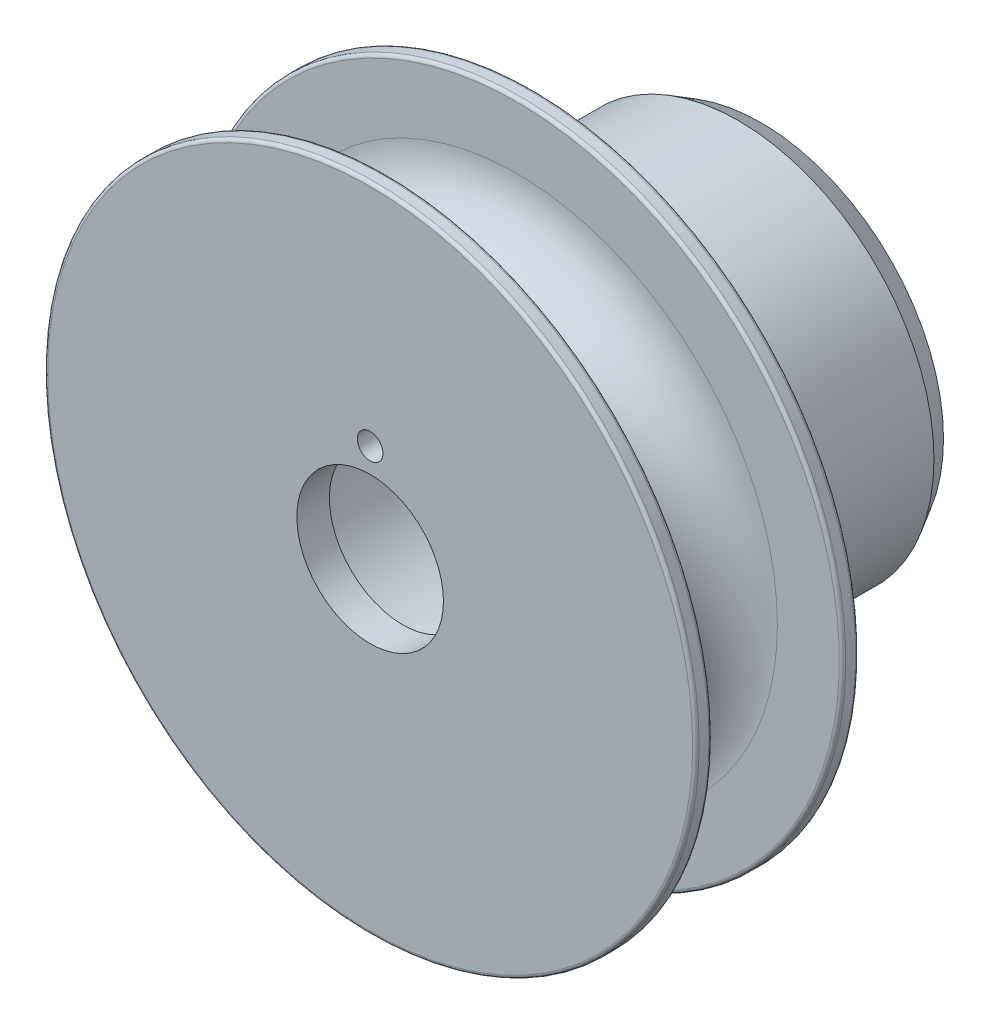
ISO-10303-21;
HEADER;
FILE_DESCRIPTION(('STEP AP214'),'2;1');
FILE_NAME('part.step','',(''),(''),'','','');
FILE_SCHEMA(('AUTOMOTIVE_DESIGN { 1 0 10303 214 1 1 1 1 }'));
ENDSEC;
DATA;
#1=APPLICATION_CONTEXT('core data for automotive mechanical design processes');
#2=APPLICATION_PROTOCOL_DEFINITION('international standard','automotive_design',2000,#1);
#3=PRODUCT_CONTEXT('',#1,'mechanical');
#4=PRODUCT('Part','Part','',(#3));
#5=PRODUCT_RELATED_PRODUCT_CATEGORY('part','',(#4));
#6=PRODUCT_DEFINITION_FORMATION('','',#4);
#7=PRODUCT_DEFINITION_CONTEXT('part definition',#1,'design');
#8=PRODUCT_DEFINITION('design','',#6,#7);
#9=PRODUCT_DEFINITION_SHAPE('','',#8);
#10=(LENGTH_UNIT() NAMED_UNIT(*) SI_UNIT(.MILLI.,.METRE.));
#11=(NAMED_UNIT(*) PLANE_ANGLE_UNIT() SI_UNIT($,.RADIAN.));
#12=(NAMED_UNIT(*) SI_UNIT($,.STERADIAN.) SOLID_ANGLE_UNIT());
#13=UNCERTAINTY_MEASURE_WITH_UNIT(LENGTH_MEASURE(1.E-05),#10,'distance_accuracy_value','');
#14=(GEOMETRIC_REPRESENTATION_CONTEXT(3) GLOBAL_UNCERTAINTY_ASSIGNED_CONTEXT((#13)) GLOBAL_UNIT_ASSIGNED_CONTEXT((#10,
#11,#12)) REPRESENTATION_CONTEXT('',''));
#15=CARTESIAN_POINT('',(0.,0.,0.));
#16=DIRECTION('',(0.,0.,1.));
#17=DIRECTION('',(1.,0.,0.));
#18=AXIS2_PLACEMENT_3D('',#15,#16,#17);
#19=CARTESIAN_POINT('',(0.,0.,-101.6));
#20=DIRECTION('',(0.,0.,1.));
#21=DIRECTION('',(1.,0.,0.));
#22=AXIS2_PLACEMENT_3D('',#19,#20,#21);
#23=CYLINDRICAL_SURFACE('',#22,22.225);
#24=CARTESIAN_POINT('',(0.,0.,-99.06));
#25=DIRECTION('',(0.,0.,1.));
#26=DIRECTION('',(1.,0.,0.));
#27=AXIS2_PLACEMENT_3D('',#24,#25,#26);
#28=CIRCLE('',#27,22.225);
#29=CARTESIAN_POINT('',(22.225,0.,-99.06));
#30=VERTEX_POINT('',#29);
#31=EDGE_CURVE('E50',#30,#30,#28,.F.);
#32=ORIENTED_EDGE('',*,*,#31,.T.);
#33=EDGE_LOOP('',(#32));
#34=FACE_BOUND('',#33,.T.);
#35=CARTESIAN_POINT('',(-22.225,0.,-94.715));
#36=CARTESIAN_POINT('',(-22.2249984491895,-0.25700302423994,-94.714998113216));
#37=CARTESIAN_POINT('',(-22.2205302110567,-0.514080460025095,-94.7046927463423));
#38=CARTESIAN_POINT('',(-22.2027681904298,-1.02639323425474,-94.66357035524));
#39=CARTESIAN_POINT('',(-22.1894691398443,-1.28162738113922,-94.6327410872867));
#40=CARTESIAN_POINT('',(-22.1543583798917,-1.78878973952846,-94.5508122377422));
#41=CARTESIAN_POINT('',(-22.132528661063,-2.04070978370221,-94.4996697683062));
#42=CARTESIAN_POINT('',(-22.080927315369,-2.53889834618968,-94.3776479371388));
#43=CARTESIAN_POINT('',(-22.0511551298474,-2.78516646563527,-94.3067671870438));
#44=CARTESIAN_POINT('',(-21.9845493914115,-3.26951998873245,-94.1462531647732));
#45=CARTESIAN_POINT('',(-21.947741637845,-3.50763165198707,-94.0566883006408));
#46=CARTESIAN_POINT('',(-21.8679013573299,-3.9751438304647,-93.8594491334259));
#47=CARTESIAN_POINT('',(-21.8248686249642,-4.20454405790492,-93.7517742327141));
#48=CARTESIAN_POINT('',(-21.7336249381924,-4.65322871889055,-93.5192281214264));
#49=CARTESIAN_POINT('',(-21.6854167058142,-4.87251838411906,-93.3943659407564));
#50=CARTESIAN_POINT('',(-21.5849243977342,-5.29999757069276,-93.1282904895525));
#51=CARTESIAN_POINT('',(-21.5326388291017,-5.50818297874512,-92.9870712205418));
#52=CARTESIAN_POINT('',(-21.3662338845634,-6.13403580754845,-92.5257927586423));
#53=CARTESIAN_POINT('',(-21.2471273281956,-6.53133021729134,-92.1793014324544));
#54=CARTESIAN_POINT('',(-21.0078722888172,-7.26423095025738,-91.4262336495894));
#55=CARTESIAN_POINT('',(-20.887723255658,-7.59980232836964,-91.0196233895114));
#56=CARTESIAN_POINT('',(-20.7130683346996,-8.05904923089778,-90.3596841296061));
#57=CARTESIAN_POINT('',(-20.6543616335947,-8.20794569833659,-90.1246672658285));
#58=CARTESIAN_POINT('',(-20.5419899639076,-8.48525995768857,-89.6417494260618));
#59=CARTESIAN_POINT('',(-20.4883229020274,-8.61368626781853,-89.3938538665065));
#60=CARTESIAN_POINT('',(-20.3878274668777,-8.84892611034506,-88.886742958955));
#61=CARTESIAN_POINT('',(-20.3409977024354,-8.95574404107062,-88.627529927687));
#62=CARTESIAN_POINT('',(-20.25584793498,-9.14670397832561,-88.0995209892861));
#63=CARTESIAN_POINT('',(-20.2175272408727,-9.23084782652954,-87.8307258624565));
#64=CARTESIAN_POINT('',(-20.152564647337,-9.3717916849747,-87.2994769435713));
#65=CARTESIAN_POINT('',(-20.1254284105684,-9.42976348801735,-87.0373945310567));
#66=CARTESIAN_POINT('',(-20.0811514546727,-9.52369096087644,-86.5084730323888));
#67=CARTESIAN_POINT('',(-20.0640104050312,-9.55964735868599,-86.2416341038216));
#68=CARTESIAN_POINT('',(-20.0403901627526,-9.60906556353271,-85.7055514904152));
#69=CARTESIAN_POINT('',(-20.0339053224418,-9.62253928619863,-85.4363091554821));
#70=CARTESIAN_POINT('',(-20.0318367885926,-9.62684535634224,-84.8976092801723));
#71=CARTESIAN_POINT('',(-20.0362524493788,-9.61767904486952,-84.6281517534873));
#72=CARTESIAN_POINT('',(-20.0549789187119,-9.57856212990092,-84.1140244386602));
#73=CARTESIAN_POINT('',(-20.0684231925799,-9.55043086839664,-83.8691818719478));
#74=CARTESIAN_POINT('',(-20.103864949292,-9.47559776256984,-83.3828948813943));
#75=CARTESIAN_POINT('',(-20.1258653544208,-9.42888957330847,-83.1414516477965));
#76=CARTESIAN_POINT('',(-20.1777230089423,-9.31739712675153,-82.6637072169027));
#77=CARTESIAN_POINT('',(-20.2075784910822,-9.25261693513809,-82.4274048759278));
#78=CARTESIAN_POINT('',(-20.2742681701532,-9.10555810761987,-81.9612300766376));
#79=CARTESIAN_POINT('',(-20.3111051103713,-9.02327259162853,-81.7313601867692));
#80=CARTESIAN_POINT('',(-20.3915685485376,-8.83995391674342,-81.2745429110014));
#81=CARTESIAN_POINT('',(-20.4353242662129,-8.73855492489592,-81.0477652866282));
#82=CARTESIAN_POINT('',(-20.5278342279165,-8.51896941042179,-80.603439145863));
#83=CARTESIAN_POINT('',(-20.5765906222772,-8.40077565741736,-80.3858946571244));
#84=CARTESIAN_POINT('',(-20.6778250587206,-8.1484142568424,-79.9611600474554));
#85=CARTESIAN_POINT('',(-20.7303035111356,-8.01424484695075,-79.7539710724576));
#86=CARTESIAN_POINT('',(-20.8376919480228,-7.73073065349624,-79.3509105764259));
#87=CARTESIAN_POINT('',(-20.8926020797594,-7.58138495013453,-79.1550397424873));
#88=CARTESIAN_POINT('',(-21.0086921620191,-7.25385262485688,-78.7579826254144));
#89=CARTESIAN_POINT('',(-21.0699831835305,-7.07427635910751,-78.5579731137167));
#90=CARTESIAN_POINT('',(-21.1922688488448,-6.69905124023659,-78.17368323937));
#91=CARTESIAN_POINT('',(-21.2532635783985,-6.50340737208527,-77.9893980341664));
#92=CARTESIAN_POINT('',(-21.3734195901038,-6.09692524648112,-77.6374539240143));
#93=CARTESIAN_POINT('',(-21.4325796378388,-5.88607706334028,-77.4698060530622));
#94=CARTESIAN_POINT('',(-21.5474582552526,-5.45053807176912,-77.1524416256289));
#95=CARTESIAN_POINT('',(-21.6031781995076,-5.2258528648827,-77.0027178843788));
#96=CARTESIAN_POINT('',(-21.7111818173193,-4.75757123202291,-76.7184305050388));
#97=CARTESIAN_POINT('',(-21.7633316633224,-4.51362754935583,-76.58438688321));
#98=CARTESIAN_POINT('',(-21.8610070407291,-4.01394963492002,-76.3374867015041));
#99=CARTESIAN_POINT('',(-21.9065323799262,-3.75821506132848,-76.2246307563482));
#100=CARTESIAN_POINT('',(-21.9896080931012,-3.23687977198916,-76.0212913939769));
#101=CARTESIAN_POINT('',(-22.0271623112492,-2.97128388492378,-75.9307971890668));
#102=CARTESIAN_POINT('',(-22.0931877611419,-2.43216034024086,-75.7731293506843));
#103=CARTESIAN_POINT('',(-22.1216597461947,-2.15863334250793,-75.705953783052));
#104=CARTESIAN_POINT('',(-22.1670596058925,-1.6245112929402,-75.599442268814));
#105=CARTESIAN_POINT('',(-22.1846349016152,-1.36428313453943,-75.5585382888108));
#106=CARTESIAN_POINT('',(-22.2106314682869,-0.840898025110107,-75.4981859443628));
#107=CARTESIAN_POINT('',(-22.2190531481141,-0.577741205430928,-75.4787366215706));
#108=CARTESIAN_POINT('',(-22.2265047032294,-0.0506593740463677,-75.4615229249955));
#109=CARTESIAN_POINT('',(-22.2255371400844,0.213265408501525,-75.4637526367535));
#110=CARTESIAN_POINT('',(-22.2142434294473,0.739836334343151,-75.489856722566));
#111=CARTESIAN_POINT('',(-22.2039175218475,1.00248251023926,-75.5137305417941));
#112=CARTESIAN_POINT('',(-22.1750118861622,1.51015077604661,-75.5809510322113));
#113=CARTESIAN_POINT('',(-22.156913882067,1.75535181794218,-75.6231626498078));
#114=CARTESIAN_POINT('',(-22.1130645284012,2.24108553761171,-75.7262508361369));
#115=CARTESIAN_POINT('',(-22.0873135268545,2.48161842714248,-75.7871265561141));
#116=CARTESIAN_POINT('',(-22.0287816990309,2.95645494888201,-75.9269627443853));
#117=CARTESIAN_POINT('',(-21.9960015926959,3.19075921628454,-76.0059213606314));
#118=CARTESIAN_POINT('',(-21.9241670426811,3.65184898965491,-76.1812686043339));
#119=CARTESIAN_POINT('',(-21.8851101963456,3.87863157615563,-76.2776639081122));
#120=CARTESIAN_POINT('',(-21.8003278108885,4.33020839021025,-76.4903430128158));
#121=CARTESIAN_POINT('',(-21.7544337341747,4.55472551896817,-76.6071485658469));
#122=CARTESIAN_POINT('',(-21.6580086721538,4.99317186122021,-76.8575842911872));
#123=CARTESIAN_POINT('',(-21.6074759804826,5.20709713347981,-76.9912206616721));
#124=CARTESIAN_POINT('',(-21.4506535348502,5.83126945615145,-77.4160163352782));
#125=CARTESIAN_POINT('',(-21.3390902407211,6.2241643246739,-77.7311812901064));
#126=CARTESIAN_POINT('',(-21.1032903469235,6.98370218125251,-78.4446677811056));
#127=CARTESIAN_POINT('',(-20.9787387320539,7.34600645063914,-78.8475189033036));
#128=CARTESIAN_POINT('',(-20.7986293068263,7.83569112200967,-79.4939381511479));
#129=CARTESIAN_POINT('',(-20.7396738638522,7.99004593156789,-79.7166044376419));
#130=CARTESIAN_POINT('',(-20.6257006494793,8.27981243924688,-80.1748481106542));
#131=CARTESIAN_POINT('',(-20.5706812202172,8.41523213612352,-80.4104199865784));
#132=CARTESIAN_POINT('',(-20.465216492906,8.66860839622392,-80.8980004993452));
#133=CARTESIAN_POINT('',(-20.4148848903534,8.78616083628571,-81.150243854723));
#134=CARTESIAN_POINT('',(-20.3218141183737,8.99933476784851,-81.665067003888));
#135=CARTESIAN_POINT('',(-20.2790714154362,9.09496647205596,-81.9276419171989));
#136=CARTESIAN_POINT('',(-20.2027446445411,9.2632760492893,-82.4612069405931));
#137=CARTESIAN_POINT('',(-20.1691558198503,9.33596584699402,-82.7321925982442));
#138=CARTESIAN_POINT('',(-20.1124315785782,9.45754943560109,-83.2805201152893));
#139=CARTESIAN_POINT('',(-20.0892950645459,9.50644572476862,-83.5578613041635));
#140=CARTESIAN_POINT('',(-20.0558525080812,9.57678354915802,-84.0936237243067));
#141=CARTESIAN_POINT('',(-20.0446524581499,9.60014217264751,-84.3517389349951));
#142=CARTESIAN_POINT('',(-20.0322699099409,9.62595450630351,-84.8692477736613));
#143=CARTESIAN_POINT('',(-20.0310868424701,9.62840940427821,-85.1286413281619));
#144=CARTESIAN_POINT('',(-20.0387807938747,9.61238599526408,-85.6465833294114));
#145=CARTESIAN_POINT('',(-20.0476561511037,9.59391114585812,-85.9051319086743));
#146=CARTESIAN_POINT('',(-20.0751420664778,9.53626300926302,-86.419381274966));
#147=CARTESIAN_POINT('',(-20.0937525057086,9.49708997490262,-86.6750820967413));
#148=CARTESIAN_POINT('',(-20.1387835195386,9.40120507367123,-87.1678595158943));
#149=CARTESIAN_POINT('',(-20.1647221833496,9.3455676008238,-87.40519071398));
#150=CARTESIAN_POINT('',(-20.2239346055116,9.21673028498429,-87.8741815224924));
#151=CARTESIAN_POINT('',(-20.2572108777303,9.14352442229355,-88.1058391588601));
#152=CARTESIAN_POINT('',(-20.3301335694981,8.98021610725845,-88.562036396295));
#153=CARTESIAN_POINT('',(-20.3697790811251,8.89011606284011,-88.7865770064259));
#154=CARTESIAN_POINT('',(-20.4543875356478,8.69368102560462,-89.2274883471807));
#155=CARTESIAN_POINT('',(-20.4993524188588,8.58734010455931,-89.4438560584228));
#156=CARTESIAN_POINT('',(-20.5963860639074,8.35204705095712,-89.8805350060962));
#157=CARTESIAN_POINT('',(-20.6487230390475,8.22209795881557,-90.1002496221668));
#158=CARTESIAN_POINT('',(-20.7566917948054,7.94558964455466,-90.5281175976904));
#159=CARTESIAN_POINT('',(-20.8123237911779,7.79902933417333,-90.7362701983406));
#160=CARTESIAN_POINT('',(-20.9254899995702,7.49009752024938,-91.1401010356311));
#161=CARTESIAN_POINT('',(-20.9830250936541,7.32771861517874,-91.3357733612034));
#162=CARTESIAN_POINT('',(-21.0985509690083,6.98812771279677,-91.7135329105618));
#163=CARTESIAN_POINT('',(-21.1565416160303,6.81091994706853,-91.8956239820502));
#164=CARTESIAN_POINT('',(-21.2763321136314,6.42743243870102,-92.2596740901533));
#165=CARTESIAN_POINT('',(-21.3380557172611,6.21996035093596,-92.440404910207));
#166=CARTESIAN_POINT('',(-21.4587450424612,5.78988330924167,-92.7837353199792));
#167=CARTESIAN_POINT('',(-21.5177116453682,5.56728324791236,-92.9463407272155));
#168=CARTESIAN_POINT('',(-21.6313411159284,5.10800344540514,-93.2524218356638));
#169=CARTESIAN_POINT('',(-21.6860008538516,4.87131368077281,-93.3958836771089));
#170=CARTESIAN_POINT('',(-21.7894465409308,4.38546620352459,-93.6623427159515));
#171=CARTESIAN_POINT('',(-21.8382329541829,4.13630947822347,-93.7853415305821));
#172=CARTESIAN_POINT('',(-21.9279318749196,3.63062869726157,-94.0082096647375));
#173=CARTESIAN_POINT('',(-21.9689422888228,3.37425058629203,-94.1083703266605));
#174=CARTESIAN_POINT('',(-22.042719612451,2.8527966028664,-94.2866340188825));
#175=CARTESIAN_POINT('',(-22.0754873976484,2.58772165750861,-94.3647393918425));
#176=CARTESIAN_POINT('',(-22.131740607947,2.0516201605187,-94.4978462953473));
#177=CARTESIAN_POINT('',(-22.1552502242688,1.78061109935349,-94.5529080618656));
#178=CARTESIAN_POINT('',(-22.1923836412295,1.23433013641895,-94.6395254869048));
#179=CARTESIAN_POINT('',(-22.2060144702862,0.959061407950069,-94.6710978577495));
#180=CARTESIAN_POINT('',(-22.217999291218,0.569286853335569,-94.6988255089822));
#181=CARTESIAN_POINT('',(-22.2206227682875,0.455535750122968,-94.7048889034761));
#182=CARTESIAN_POINT('',(-22.2241234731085,0.227861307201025,-94.7129765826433));
#183=CARTESIAN_POINT('',(-22.2250006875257,0.113937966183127,-94.7150008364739));
#184=CARTESIAN_POINT('',(-22.225,0.,-94.715));
#185=B_SPLINE_CURVE_WITH_KNOTS('',3,(#35,#36,#37,#38,#39,#40,#41,#42,#43,#44,#45,#46,#47,#48,
#49,#50,#51,#52,#53,#54,#55,#56,#57,#58,#59,#60,#61,#62,#63,#64,#65,#66,#67,#68,#69,#70,#71,#72,
#73,#74,#75,#76,#77,#78,#79,#80,#81,#82,#83,#84,#85,#86,#87,#88,#89,#90,#91,#92,#93,#94,#95,#96,
#97,#98,#99,#100,#101,#102,#103,#104,#105,#106,#107,#108,#109,#110,#111,#112,#113,#114,#115,
#116,#117,#118,#119,#120,#121,#122,#123,#124,#125,#126,#127,#128,#129,#130,#131,#132,#133,#134,
#135,#136,#137,#138,#139,#140,#141,#142,#143,#144,#145,#146,#147,#148,#149,#150,#151,#152,#153,
#154,#155,#156,#157,#158,#159,#160,#161,#162,#163,#164,#165,#166,#167,#168,#169,#170,#171,#172,
#173,#174,#175,#176,#177,#178,#179,#180,#181,#182,#183,#184),.UNSPECIFIED.,.T.,.F.,(4,2,2,2,2,2,
2,2,2,2,2,2,2,2,2,2,2,2,2,2,2,2,2,2,2,2,2,2,2,2,2,2,2,2,2,2,2,2,2,2,2,2,2,2,2,2,2,2,2,2,2,2,2,2,
2,2,2,2,2,2,2,2,2,2,2,2,2,2,2,2,2,2,2,2,4),(0.,0.770894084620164,1.54224846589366,
2.31524016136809,3.08828624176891,3.85855014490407,4.62883947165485,5.39872563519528,
6.16889503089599,7.78282568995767,9.39766729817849,10.2497812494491,11.1015396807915,
11.9531245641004,12.8046402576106,13.6129048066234,14.4211426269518,15.2289519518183,
16.036713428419,16.7763051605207,17.5161497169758,18.2558279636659,18.9957974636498,
19.7517150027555,20.5079589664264,21.2642864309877,22.0206597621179,22.8468146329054,
23.6727141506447,24.4991578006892,25.3252690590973,26.1737402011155,27.0222359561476,
27.8703215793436,28.7183368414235,29.5093400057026,30.3003078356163,31.0910598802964,
31.8817916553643,32.6293256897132,33.3768257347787,34.124249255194,34.8719595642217,
35.6427331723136,36.413791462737,37.9550702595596,39.6148115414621,40.4458381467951,
41.2765126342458,42.1238257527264,42.970743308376,43.8172199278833,44.6636076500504,
45.4408275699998,46.2180033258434,46.9950507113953,47.7720886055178,48.5067004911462,
49.2415644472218,49.9763237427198,50.711351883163,51.4922525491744,52.2732044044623,
53.0545234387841,53.8356202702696,54.6805847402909,55.5252772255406,56.3705779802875,
57.2158118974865,58.0495706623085,58.8832408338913,59.7147179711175,60.5456029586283,
60.887363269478,61.2291261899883),.UNSPECIFIED.);
#186=CARTESIAN_POINT('',(-22.225,0.,-94.715));
#187=VERTEX_POINT('',#186);
#188=EDGE_CURVE('E72',#187,#187,#185,.T.);
#189=ORIENTED_EDGE('',*,*,#188,.T.);
#190=EDGE_LOOP('',(#189));
#191=FACE_BOUND('',#190,.T.);
#192=CARTESIAN_POINT('',(0.,0.,-31.75));
#193=DIRECTION('',(0.,0.,1.));
#194=DIRECTION('',(1.,0.,0.));
#195=AXIS2_PLACEMENT_3D('',#192,#193,#194);
#196=CIRCLE('',#195,22.225);
#197=CARTESIAN_POINT('',(22.225,0.,-31.75));
#198=VERTEX_POINT('',#197);
#199=EDGE_CURVE('E63',#198,#198,#196,.F.);
#200=ORIENTED_EDGE('',*,*,#199,.F.);
#201=EDGE_LOOP('',(#200));
#202=FACE_BOUND('',#201,.T.);
#203=ADVANCED_FACE('F42',(#34,#191,#202),#23,.F.);
#204=CARTESIAN_POINT('',(0.,0.,-101.6));
#205=DIRECTION('',(0.,0.,1.));
#206=DIRECTION('',(1.,0.,0.));
#207=AXIS2_PLACEMENT_3D('',#204,#205,#206);
#208=CYLINDRICAL_SURFACE('',#207,38.1);
#209=CARTESIAN_POINT('',(0.,0.,-97.2005909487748));
#210=DIRECTION('',(0.,0.,1.));
#211=DIRECTION('',(1.,0.,0.));
#212=AXIS2_PLACEMENT_3D('',#209,#210,#211);
#213=CIRCLE('',#212,38.1);
#214=CARTESIAN_POINT('',(38.1,0.,-97.2005909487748));
#215=VERTEX_POINT('',#214);
#216=EDGE_CURVE('E10',#215,#215,#213,.T.);
#217=ORIENTED_EDGE('',*,*,#216,.T.);
#218=EDGE_LOOP('',(#217));
#219=FACE_BOUND('',#218,.T.);
#220=CARTESIAN_POINT('',(-38.1,0.,-94.715));
#221=CARTESIAN_POINT('',(-38.0999993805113,-0.265824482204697,-94.7149989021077));
#222=CARTESIAN_POINT('',(-38.0972110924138,-0.531670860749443,-94.7039783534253));
#223=CARTESIAN_POINT('',(-38.0861334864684,-1.06144206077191,-94.659986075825));
#224=CARTESIAN_POINT('',(-38.0778435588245,-1.32536666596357,-94.62701191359));
#225=CARTESIAN_POINT('',(-38.0559875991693,-1.84949605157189,-94.5393712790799));
#226=CARTESIAN_POINT('',(-38.0424190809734,-2.10969901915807,-94.4846945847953));
#227=CARTESIAN_POINT('',(-38.0103796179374,-2.62441230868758,-94.3541019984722));
#228=CARTESIAN_POINT('',(-37.9919085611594,-2.87892250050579,-94.2781856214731));
#229=CARTESIAN_POINT('',(-37.9505946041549,-3.3801679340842,-94.1058328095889));
#230=CARTESIAN_POINT('',(-37.9277572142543,-3.62691252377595,-94.009422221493));
#231=CARTESIAN_POINT('',(-37.8783110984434,-4.11130477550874,-93.7967654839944));
#232=CARTESIAN_POINT('',(-37.851702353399,-4.34895239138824,-93.6805192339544));
#233=CARTESIAN_POINT('',(-37.7954282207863,-4.81356014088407,-93.429066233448));
#234=CARTESIAN_POINT('',(-37.7657633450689,-5.04052205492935,-93.2938626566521));
#235=CARTESIAN_POINT('',(-37.7041471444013,-5.48243431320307,-93.0053770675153));
#236=CARTESIAN_POINT('',(-37.67219500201,-5.69738031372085,-92.8520885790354));
#237=CARTESIAN_POINT('',(-37.6062517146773,-6.11767259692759,-92.5255115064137));
#238=CARTESIAN_POINT('',(-37.5722338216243,-6.3227684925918,-92.3519060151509));
#239=CARTESIAN_POINT('',(-37.5036226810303,-6.71777484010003,-91.9881338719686));
#240=CARTESIAN_POINT('',(-37.4690291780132,-6.90767831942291,-91.7979596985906));
#241=CARTESIAN_POINT('',(-37.4002282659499,-7.27097781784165,-91.4023402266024));
#242=CARTESIAN_POINT('',(-37.3660209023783,-7.44437191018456,-91.1968931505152));
#243=CARTESIAN_POINT('',(-37.2989617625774,-7.77339282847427,-90.7721753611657));
#244=CARTESIAN_POINT('',(-37.2661093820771,-7.92902763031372,-90.5529109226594));
#245=CARTESIAN_POINT('',(-37.2021717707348,-8.22383923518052,-90.0983549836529));
#246=CARTESIAN_POINT('',(-37.1711223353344,-8.36271964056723,-89.862866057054));
#247=CARTESIAN_POINT('',(-37.1122926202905,-8.6200440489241,-89.3807004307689));
#248=CARTESIAN_POINT('',(-37.0845110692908,-8.73849600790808,-89.1340281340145));
#249=CARTESIAN_POINT('',(-37.0330427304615,-8.95410749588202,-88.6311074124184));
#250=CARTESIAN_POINT('',(-37.0093562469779,-9.05126544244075,-88.3748582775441));
#251=CARTESIAN_POINT('',(-36.9668155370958,-9.22347144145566,-87.8546451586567));
#252=CARTESIAN_POINT('',(-36.9479611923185,-9.29852003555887,-87.5906813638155));
#253=CARTESIAN_POINT('',(-36.9160106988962,-9.42455818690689,-87.0624465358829));
#254=CARTESIAN_POINT('',(-36.9028048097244,-9.47600782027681,-86.7982918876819));
#255=CARTESIAN_POINT('',(-36.8820097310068,-9.55662581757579,-86.2663843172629));
#256=CARTESIAN_POINT('',(-36.8744204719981,-9.58579445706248,-85.9986314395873));
#257=CARTESIAN_POINT('',(-36.8650966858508,-9.62158978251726,-85.4615602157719));
#258=CARTESIAN_POINT('',(-36.863361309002,-9.62821974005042,-85.1922421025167));
#259=CARTESIAN_POINT('',(-36.8657976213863,-9.61888714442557,-84.6540266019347));
#260=CARTESIAN_POINT('',(-36.8699692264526,-9.60292491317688,-84.385129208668));
#261=CARTESIAN_POINT('',(-36.8839122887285,-9.5492280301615,-83.8564224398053));
#262=CARTESIAN_POINT('',(-36.8935421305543,-9.51204382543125,-83.5965531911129));
#263=CARTESIAN_POINT('',(-36.9180078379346,-9.41664052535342,-83.0809607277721));
#264=CARTESIAN_POINT('',(-36.9328436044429,-9.35842183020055,-82.8252374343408));
#265=CARTESIAN_POINT('',(-36.9672855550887,-9.22143043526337,-82.3197263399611));
#266=CARTESIAN_POINT('',(-36.9868911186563,-9.14266040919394,-82.0699377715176));
#267=CARTESIAN_POINT('',(-37.0303192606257,-8.96514364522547,-81.5778396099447));
#268=CARTESIAN_POINT('',(-37.0541434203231,-8.86638941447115,-81.3355328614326));
#269=CARTESIAN_POINT('',(-37.1055918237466,-8.64856618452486,-80.8576757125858));
#270=CARTESIAN_POINT('',(-37.133251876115,-8.52930286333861,-80.6222177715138));
#271=CARTESIAN_POINT('',(-37.1914113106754,-8.27201976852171,-80.1621418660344));
#272=CARTESIAN_POINT('',(-37.2219108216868,-8.13399914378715,-79.9375243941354));
#273=CARTESIAN_POINT('',(-37.2849144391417,-7.84013587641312,-79.500524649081));
#274=CARTESIAN_POINT('',(-37.3174188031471,-7.68429094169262,-79.2881439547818));
#275=CARTESIAN_POINT('',(-37.3835520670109,-7.35582046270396,-78.8769674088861));
#276=CARTESIAN_POINT('',(-37.4171809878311,-7.18319460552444,-78.6781718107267));
#277=CARTESIAN_POINT('',(-37.4856546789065,-6.81699243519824,-78.289813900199));
#278=CARTESIAN_POINT('',(-37.5205062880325,-6.62295169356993,-78.1006904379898));
#279=CARTESIAN_POINT('',(-37.5894802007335,-6.21955311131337,-77.739415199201));
#280=CARTESIAN_POINT('',(-37.623602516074,-6.01019551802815,-77.5672631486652));
#281=CARTESIAN_POINT('',(-37.6901792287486,-5.57748239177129,-77.2410674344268));
#282=CARTESIAN_POINT('',(-37.7226332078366,-5.35412337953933,-77.0870282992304));
#283=CARTESIAN_POINT('',(-37.7849487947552,-4.89502586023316,-76.798265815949));
#284=CARTESIAN_POINT('',(-37.8148114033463,-4.65929218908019,-76.6635349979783));
#285=CARTESIAN_POINT('',(-37.8712300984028,-4.17604156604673,-76.4138517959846));
#286=CARTESIAN_POINT('',(-37.897773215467,-3.92848331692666,-76.2989763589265));
#287=CARTESIAN_POINT('',(-37.946665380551,-3.42414438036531,-76.0905383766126));
#288=CARTESIAN_POINT('',(-37.9690144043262,-3.16736363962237,-75.9969759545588));
#289=CARTESIAN_POINT('',(-38.0088726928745,-2.64647092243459,-75.83195247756));
#290=CARTESIAN_POINT('',(-38.0263827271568,-2.38236011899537,-75.7604879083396));
#291=CARTESIAN_POINT('',(-38.0560587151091,-1.84872770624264,-75.6402576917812));
#292=CARTESIAN_POINT('',(-38.0682248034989,-1.57920623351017,-75.5914914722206));
#293=CARTESIAN_POINT('',(-38.0866139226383,-1.04388135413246,-75.5180611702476));
#294=CARTESIAN_POINT('',(-38.092983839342,-0.778164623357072,-75.4928009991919));
#295=CARTESIAN_POINT('',(-38.1001402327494,-0.245477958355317,-75.4644349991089));
#296=CARTESIAN_POINT('',(-38.1009268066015,0.0214919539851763,-75.4613287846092));
#297=CARTESIAN_POINT('',(-38.0968946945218,0.554701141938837,-75.4772964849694));
#298=CARTESIAN_POINT('',(-38.0920764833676,0.820940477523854,-75.496368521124));
#299=CARTESIAN_POINT('',(-38.0769704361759,1.35076193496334,-75.5565248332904));
#300=CARTESIAN_POINT('',(-38.0666826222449,1.61434406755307,-75.5976090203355));
#301=CARTESIAN_POINT('',(-38.0411227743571,2.13291808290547,-75.7006393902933));
#302=CARTESIAN_POINT('',(-38.025929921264,2.38797974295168,-75.7622546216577));
#303=CARTESIAN_POINT('',(-37.9909207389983,2.89202174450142,-75.9060170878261));
#304=CARTESIAN_POINT('',(-37.9711027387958,3.14099985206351,-75.9881717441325));
#305=CARTESIAN_POINT('',(-37.9273748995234,3.63108197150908,-76.1723552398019));
#306=CARTESIAN_POINT('',(-37.9034655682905,3.87218695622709,-76.2743816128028));
#307=CARTESIAN_POINT('',(-37.8521803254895,4.3449971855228,-76.4975632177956));
#308=CARTESIAN_POINT('',(-37.8248042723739,4.5767020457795,-76.6187192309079));
#309=CARTESIAN_POINT('',(-37.7667799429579,5.03331423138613,-76.8816492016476));
#310=CARTESIAN_POINT('',(-37.7360816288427,5.25802407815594,-77.0237550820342));
#311=CARTESIAN_POINT('',(-37.6726510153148,5.69474000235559,-77.3259114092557));
#312=CARTESIAN_POINT('',(-37.6399186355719,5.90674557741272,-77.485962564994));
#313=CARTESIAN_POINT('',(-37.5732889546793,6.31673199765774,-77.8229548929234));
#314=CARTESIAN_POINT('',(-37.5393914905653,6.51471086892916,-77.9998984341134));
#315=CARTESIAN_POINT('',(-37.4713412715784,6.89535887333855,-78.3695067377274));
#316=CARTESIAN_POINT('',(-37.4371885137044,7.07802782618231,-78.5621716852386));
#317=CARTESIAN_POINT('',(-37.3686871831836,7.43131337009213,-78.9670748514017));
#318=CARTESIAN_POINT('',(-37.3343556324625,7.60150651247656,-79.1796856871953));
#319=CARTESIAN_POINT('',(-37.2673872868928,7.92331082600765,-79.6186383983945));
#320=CARTESIAN_POINT('',(-37.2347497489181,8.07493018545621,-79.8449741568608));
#321=CARTESIAN_POINT('',(-37.172089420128,8.3586417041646,-80.310046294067));
#322=CARTESIAN_POINT('',(-37.1420676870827,8.49072597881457,-80.5487876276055));
#323=CARTESIAN_POINT('',(-37.0855574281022,8.73424629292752,-81.0368636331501));
#324=CARTESIAN_POINT('',(-37.0590674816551,8.84569064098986,-81.2861939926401));
#325=CARTESIAN_POINT('',(-37.0105523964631,9.04652586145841,-81.7923208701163));
#326=CARTESIAN_POINT('',(-36.988502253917,9.1360408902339,-82.0490656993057));
#327=CARTESIAN_POINT('',(-36.9493525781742,9.2931105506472,-82.5695606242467));
#328=CARTESIAN_POINT('',(-36.9322530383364,9.36066521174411,-82.8333107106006));
#329=CARTESIAN_POINT('',(-36.9035430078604,9.47321973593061,-83.3658253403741));
#330=CARTESIAN_POINT('',(-36.8919314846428,9.5182238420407,-83.6345889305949));
#331=CARTESIAN_POINT('',(-36.8745625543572,9.58529303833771,-84.1751488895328));
#332=CARTESIAN_POINT('',(-36.8688050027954,9.60735869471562,-84.4469451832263));
#333=CARTESIAN_POINT('',(-36.8634083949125,9.62804376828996,-84.9834843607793));
#334=CARTESIAN_POINT('',(-36.8635945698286,9.62733290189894,-85.2481998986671));
#335=CARTESIAN_POINT('',(-36.8696489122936,9.60412064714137,-85.7766044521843));
#336=CARTESIAN_POINT('',(-36.8755169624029,9.58161970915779,-86.0402934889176));
#337=CARTESIAN_POINT('',(-36.8927572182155,9.51502199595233,-86.5647375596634));
#338=CARTESIAN_POINT('',(-36.9041292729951,9.47092581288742,-86.8254926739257));
#339=CARTESIAN_POINT('',(-36.9320367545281,9.36150861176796,-87.3422276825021));
#340=CARTESIAN_POINT('',(-36.948572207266,9.29618748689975,-87.5982075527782));
#341=CARTESIAN_POINT('',(-36.98619694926,9.14533929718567,-88.101991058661));
#342=CARTESIAN_POINT('',(-37.0072562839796,9.05994481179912,-88.3498366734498));
#343=CARTESIAN_POINT('',(-37.0533968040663,8.86935144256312,-88.8375048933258));
#344=CARTESIAN_POINT('',(-37.0784794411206,8.76414540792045,-89.0773245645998));
#345=CARTESIAN_POINT('',(-37.1319568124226,8.53473176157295,-89.5472801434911));
#346=CARTESIAN_POINT('',(-37.1603512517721,8.41052584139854,-89.777416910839));
#347=CARTESIAN_POINT('',(-37.2196777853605,8.14396842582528,-90.226595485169));
#348=CARTESIAN_POINT('',(-37.2506100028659,8.00161604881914,-90.4456367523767));
#349=CARTESIAN_POINT('',(-37.3150275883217,7.69569923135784,-90.8769321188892));
#350=CARTESIAN_POINT('',(-37.3485589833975,7.53167127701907,-91.0888507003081));
#351=CARTESIAN_POINT('',(-37.4164894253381,7.18660091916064,-91.4982022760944));
#352=CARTESIAN_POINT('',(-37.4508884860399,7.00555824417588,-91.6956350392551));
#353=CARTESIAN_POINT('',(-37.519619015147,6.62760004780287,-92.0747841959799));
#354=CARTESIAN_POINT('',(-37.5539504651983,6.43068069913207,-92.2564967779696));
#355=CARTESIAN_POINT('',(-37.6216018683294,6.02228406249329,-92.6029503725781));
#356=CARTESIAN_POINT('',(-37.6549218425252,5.8108070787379,-92.7676917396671));
#357=CARTESIAN_POINT('',(-37.7202567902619,5.37053733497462,-93.082026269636));
#358=CARTESIAN_POINT('',(-37.7522353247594,5.14149331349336,-93.2312753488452));
#359=CARTESIAN_POINT('',(-37.8132883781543,4.67133642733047,-93.5098499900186));
#360=CARTESIAN_POINT('',(-37.8423639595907,4.43022802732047,-93.639182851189));
#361=CARTESIAN_POINT('',(-37.8967859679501,3.93763718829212,-93.876945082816));
#362=CARTESIAN_POINT('',(-37.922133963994,3.68615917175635,-93.9853832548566));
#363=CARTESIAN_POINT('',(-37.9683848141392,3.17453755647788,-94.1805373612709));
#364=CARTESIAN_POINT('',(-37.9892883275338,2.91439524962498,-94.2672565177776));
#365=CARTESIAN_POINT('',(-38.0226532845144,2.43603406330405,-94.4043080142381));
#366=CARTESIAN_POINT('',(-38.0359608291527,2.21894307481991,-94.4584023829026));
#367=CARTESIAN_POINT('',(-38.0589648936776,1.78134181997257,-94.5513671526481));
#368=CARTESIAN_POINT('',(-38.0686616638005,1.56083179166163,-94.5902386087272));
#369=CARTESIAN_POINT('',(-38.0842543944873,1.11748406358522,-94.6525294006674));
#370=CARTESIAN_POINT('',(-38.0901499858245,0.894646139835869,-94.6759472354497));
#371=CARTESIAN_POINT('',(-38.098022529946,0.447877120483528,-94.7071809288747));
#372=CARTESIAN_POINT('',(-38.1000005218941,0.223946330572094,-94.7150009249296));
#373=CARTESIAN_POINT('',(-38.1,0.,-94.715));
#374=B_SPLINE_CURVE_WITH_KNOTS('',3,(#220,#221,#222,#223,#224,#225,#226,#227,#228,#229,#230,
#231,#232,#233,#234,#235,#236,#237,#238,#239,#240,#241,#242,#243,#244,#245,#246,#247,#248,#249,
#250,#251,#252,#253,#254,#255,#256,#257,#258,#259,#260,#261,#262,#263,#264,#265,#266,#267,#268,
#269,#270,#271,#272,#273,#274,#275,#276,#277,#278,#279,#280,#281,#282,#283,#284,#285,#286,#287,
#288,#289,#290,#291,#292,#293,#294,#295,#296,#297,#298,#299,#300,#301,#302,#303,#304,#305,#306,
#307,#308,#309,#310,#311,#312,#313,#314,#315,#316,#317,#318,#319,#320,#321,#322,#323,#324,#325,
#326,#327,#328,#329,#330,#331,#332,#333,#334,#335,#336,#337,#338,#339,#340,#341,#342,#343,#344,
#345,#346,#347,#348,#349,#350,#351,#352,#353,#354,#355,#356,#357,#358,#359,#360,#361,#362,#363,
#364,#365,#366,#367,#368,#369,#370,#371,#372,#373),.UNSPECIFIED.,.T.,.F.,(4,2,2,2,2,2,2,2,2,2,2,
2,2,2,2,2,2,2,2,2,2,2,2,2,2,2,2,2,2,2,2,2,2,2,2,2,2,2,2,2,2,2,2,2,2,2,2,2,2,2,2,2,2,2,2,2,2,2,2,
2,2,2,2,2,2,2,2,2,2,2,2,2,2,2,2,2,4),(0.,0.797269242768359,1.59462686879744,2.39236050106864,
3.19011234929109,3.98686399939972,4.78361969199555,5.58024215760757,6.37715076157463,
7.1887670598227,8.00075373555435,8.81283505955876,9.62455022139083,10.4489957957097,
11.2731195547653,12.0973045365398,12.9214693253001,13.7288013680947,14.5361234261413,
15.3433282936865,16.150521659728,16.9376725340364,17.7248084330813,18.5118419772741,
19.2991711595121,20.0944187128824,20.8897023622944,21.6850883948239,22.4804892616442,
23.2991058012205,24.1177091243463,24.9365166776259,25.7550065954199,26.5766006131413,
27.3981993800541,28.2196674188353,29.0411147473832,29.841113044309,30.6410974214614,
31.441014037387,32.2409274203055,33.02852454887,33.816406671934,34.6041910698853,
35.3920076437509,36.1940075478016,36.9960391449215,37.7981833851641,38.6003370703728,
39.4228454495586,40.2449899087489,41.0674652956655,41.889608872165,42.70698420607,
43.5243584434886,44.3415788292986,45.1587790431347,45.9519731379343,46.745150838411,
47.5383067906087,48.3314667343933,49.1195283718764,49.9078749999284,50.6961514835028,
51.4844662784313,52.2937500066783,53.1030466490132,53.9125389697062,54.7220143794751,
55.546748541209,56.3711797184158,57.1952628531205,58.0192236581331,58.691050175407,
59.3628301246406,60.0346753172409,60.7063422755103),.UNSPECIFIED.);
#375=CARTESIAN_POINT('',(-38.1,0.,-94.715));
#376=VERTEX_POINT('',#375);
#377=EDGE_CURVE('E64',#376,#376,#374,.T.);
#378=ORIENTED_EDGE('',*,*,#377,.F.);
#379=EDGE_LOOP('',(#378));
#380=FACE_BOUND('',#379,.T.);
#381=CARTESIAN_POINT('',(0.,0.,-69.85));
#382=DIRECTION('',(0.,0.,-1.));
#383=DIRECTION('',(-1.,0.,0.));
#384=AXIS2_PLACEMENT_3D('',#381,#382,#383);
#385=CIRCLE('',#384,38.1);
#386=CARTESIAN_POINT('',(-38.1,0.,-69.85));
#387=VERTEX_POINT('',#386);
#388=EDGE_CURVE('E139',#387,#387,#385,.T.);
#389=ORIENTED_EDGE('',*,*,#388,.T.);
#390=EDGE_LOOP('',(#389));
#391=FACE_BOUND('',#390,.T.);
#392=ADVANCED_FACE('F74',(#219,#380,#391),#208,.T.);
#393=CARTESIAN_POINT('',(0.,0.,-101.6));
#394=DIRECTION('',(0.,0.,1.));
#395=DIRECTION('',(1.,0.,0.));
#396=AXIS2_PLACEMENT_3D('',#393,#394,#395);
#397=PLANE('',#396);
#398=CARTESIAN_POINT('',(0.,0.,-101.6));
#399=DIRECTION('',(0.,0.,1.));
#400=DIRECTION('',(1.,0.,0.));
#401=AXIS2_PLACEMENT_3D('',#398,#399,#400);
#402=CIRCLE('',#401,26.6244090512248);
#403=CARTESIAN_POINT('',(26.6244090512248,0.,-101.6));
#404=VERTEX_POINT('',#403);
#405=EDGE_CURVE('E54',#404,#404,#402,.T.);
#406=ORIENTED_EDGE('',*,*,#405,.T.);
#407=EDGE_LOOP('',(#406));
#408=FACE_BOUND('',#407,.T.);
#409=CARTESIAN_POINT('',(0.,0.,-101.6));
#410=DIRECTION('',(0.,0.,1.));
#411=DIRECTION('',(1.,0.,0.));
#412=AXIS2_PLACEMENT_3D('',#409,#410,#411);
#413=CIRCLE('',#412,35.5599999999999);
#414=CARTESIAN_POINT('',(35.5599999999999,0.,-101.6));
#415=VERTEX_POINT('',#414);
#416=EDGE_CURVE('E58',#415,#415,#413,.F.);
#417=ORIENTED_EDGE('',*,*,#416,.T.);
#418=EDGE_LOOP('',(#417));
#419=FACE_BOUND('',#418,.T.);
#420=ADVANCED_FACE('F103',(#408,#419),#397,.F.);
#421=CARTESIAN_POINT('',(0.,0.,-25.4));
#422=DIRECTION('',(0.,0.,1.));
#423=DIRECTION('',(1.,0.,0.));
#424=AXIS2_PLACEMENT_3D('',#421,#422,#423);
#425=PLANE('',#424);
#426=CARTESIAN_POINT('',(0.,0.,-25.4));
#427=DIRECTION('',(0.,0.,1.));
#428=DIRECTION('',(1.,0.,0.));
#429=AXIS2_PLACEMENT_3D('',#426,#427,#428);
#430=CIRCLE('',#429,62.865);
#431=CARTESIAN_POINT('',(62.865,0.,-25.4));
#432=VERTEX_POINT('',#431);
#433=EDGE_CURVE('E119',#432,#432,#430,.T.);
#434=ORIENTED_EDGE('',*,*,#433,.T.);
#435=EDGE_LOOP('',(#434));
#436=FACE_BOUND('',#435,.T.);
#437=CARTESIAN_POINT('',(0.,19.05,-25.4));
#438=DIRECTION('',(0.,0.,1.));
#439=DIRECTION('',(1.,0.,0.));
#440=AXIS2_PLACEMENT_3D('',#437,#438,#439);
#441=CIRCLE('',#440,2.4892);
#442=CARTESIAN_POINT('',(2.4892,19.05,-25.4));
#443=VERTEX_POINT('',#442);
#444=EDGE_CURVE('E94',#443,#443,#441,.T.);
#445=ORIENTED_EDGE('',*,*,#444,.F.);
#446=EDGE_LOOP('',(#445));
#447=FACE_BOUND('',#446,.T.);
#448=CARTESIAN_POINT('',(0.,0.,-25.4));
#449=DIRECTION('',(0.,0.,1.));
#450=DIRECTION('',(1.,0.,0.));
#451=AXIS2_PLACEMENT_3D('',#448,#449,#450);
#452=CIRCLE('',#451,14.2875);
#453=CARTESIAN_POINT('',(14.2875,0.,-25.4));
#454=VERTEX_POINT('',#453);
#455=EDGE_CURVE('E125',#454,#454,#452,.T.);
#456=ORIENTED_EDGE('',*,*,#455,.F.);
#457=EDGE_LOOP('',(#456));
#458=FACE_BOUND('',#457,.T.);
#459=ADVANCED_FACE('F105',(#436,#447,#458),#425,.T.);
#460=CARTESIAN_POINT('',(0.,0.,-28.575));
#461=DIRECTION('',(0.,0.,1.));
#462=DIRECTION('',(1.,0.,0.));
#463=AXIS2_PLACEMENT_3D('',#460,#461,#462);
#464=CYLINDRICAL_SURFACE('',#463,63.5);
#465=CARTESIAN_POINT('',(0.,0.,-27.94));
#466=DIRECTION('',(0.,0.,1.));
#467=DIRECTION('',(1.,0.,0.));
#468=AXIS2_PLACEMENT_3D('',#465,#466,#467);
#469=CIRCLE('',#468,63.5);
#470=CARTESIAN_POINT('',(63.5,0.,-27.94));
#471=VERTEX_POINT('',#470);
#472=EDGE_CURVE('E150',#471,#471,#469,.T.);
#473=ORIENTED_EDGE('',*,*,#472,.T.);
#474=EDGE_LOOP('',(#473));
#475=FACE_BOUND('',#474,.T.);
#476=CARTESIAN_POINT('',(0.,0.,-26.035));
#477=DIRECTION('',(0.,0.,1.));
#478=DIRECTION('',(1.,0.,0.));
#479=AXIS2_PLACEMENT_3D('',#476,#477,#478);
#480=CIRCLE('',#479,63.5);
#481=CARTESIAN_POINT('',(63.5,0.,-26.035));
#482=VERTEX_POINT('',#481);
#483=EDGE_CURVE('E145',#482,#482,#480,.F.);
#484=ORIENTED_EDGE('',*,*,#483,.T.);
#485=EDGE_LOOP('',(#484));
#486=FACE_BOUND('',#485,.T.);
#487=ADVANCED_FACE('F101',(#475,#486),#464,.T.);
#488=CARTESIAN_POINT('',(0.,0.,-28.575));
#489=DIRECTION('',(0.,0.,1.));
#490=DIRECTION('',(1.,0.,0.));
#491=AXIS2_PLACEMENT_3D('',#488,#489,#490);
#492=PLANE('',#491);
#493=CARTESIAN_POINT('',(0.,0.,-28.575));
#494=DIRECTION('',(0.,0.,1.));
#495=DIRECTION('',(1.,0.,0.));
#496=AXIS2_PLACEMENT_3D('',#493,#494,#495);
#497=CIRCLE('',#496,62.865);
#498=CARTESIAN_POINT('',(62.865,0.,-28.575));
#499=VERTEX_POINT('',#498);
#500=EDGE_CURVE('E153',#499,#499,#497,.F.);
#501=ORIENTED_EDGE('',*,*,#500,.T.);
#502=EDGE_LOOP('',(#501));
#503=FACE_BOUND('',#502,.T.);
#504=CARTESIAN_POINT('',(0.,0.,-28.575));
#505=DIRECTION('',(0.,0.,1.));
#506=DIRECTION('',(1.,0.,0.));
#507=AXIS2_PLACEMENT_3D('',#504,#505,#506);
#508=CIRCLE('',#507,50.8);
#509=CARTESIAN_POINT('',(50.8,0.,-28.575));
#510=VERTEX_POINT('',#509);
#511=EDGE_CURVE('E142',#510,#510,#508,.T.);
#512=ORIENTED_EDGE('',*,*,#511,.T.);
#513=EDGE_LOOP('',(#512));
#514=FACE_BOUND('',#513,.T.);
#515=ADVANCED_FACE('F114',(#503,#514),#492,.F.);
#516=CARTESIAN_POINT('',(0.,0.,-53.975));
#517=DIRECTION('',(0.,0.,-1.));
#518=DIRECTION('',(1.,0.,0.));
#519=AXIS2_PLACEMENT_3D('',#516,#517,#518);
#520=PLANE('',#519);
#521=CARTESIAN_POINT('',(0.,0.,-53.975));
#522=DIRECTION('',(0.,0.,-1.));
#523=DIRECTION('',(-1.,0.,0.));
#524=AXIS2_PLACEMENT_3D('',#521,#522,#523);
#525=CIRCLE('',#524,62.865);
#526=CARTESIAN_POINT('',(-62.865,0.,-53.975));
#527=VERTEX_POINT('',#526);
#528=EDGE_CURVE('E156',#527,#527,#525,.F.);
#529=ORIENTED_EDGE('',*,*,#528,.T.);
#530=EDGE_LOOP('',(#529));
#531=FACE_BOUND('',#530,.T.);
#532=CARTESIAN_POINT('',(0.,0.,-53.975));
#533=DIRECTION('',(0.,0.,-1.));
#534=DIRECTION('',(-1.,0.,0.));
#535=AXIS2_PLACEMENT_3D('',#532,#533,#534);
#536=CIRCLE('',#535,50.8);
#537=CARTESIAN_POINT('',(-50.8,0.,-53.975));
#538=VERTEX_POINT('',#537);
#539=EDGE_CURVE('E132',#538,#538,#536,.T.);
#540=ORIENTED_EDGE('',*,*,#539,.T.);
#541=EDGE_LOOP('',(#540));
#542=FACE_BOUND('',#541,.T.);
#543=ADVANCED_FACE('F192',(#531,#542),#520,.F.);
#544=CARTESIAN_POINT('',(0.,0.,-57.15));
#545=DIRECTION('',(0.,0.,-1.));
#546=DIRECTION('',(1.,0.,0.));
#547=AXIS2_PLACEMENT_3D('',#544,#545,#546);
#548=PLANE('',#547);
#549=CARTESIAN_POINT('',(0.,0.,-57.15));
#550=DIRECTION('',(0.,0.,-1.));
#551=DIRECTION('',(-1.,0.,0.));
#552=AXIS2_PLACEMENT_3D('',#549,#550,#551);
#553=CIRCLE('',#552,62.865);
#554=CARTESIAN_POINT('',(-62.865,0.,-57.15));
#555=VERTEX_POINT('',#554);
#556=EDGE_CURVE('E165',#555,#555,#553,.T.);
#557=ORIENTED_EDGE('',*,*,#556,.T.);
#558=EDGE_LOOP('',(#557));
#559=FACE_BOUND('',#558,.T.);
#560=CARTESIAN_POINT('',(0.,0.,-57.15));
#561=DIRECTION('',(0.,0.,-1.));
#562=DIRECTION('',(-1.,0.,0.));
#563=AXIS2_PLACEMENT_3D('',#560,#561,#562);
#564=CIRCLE('',#563,50.8);
#565=CARTESIAN_POINT('',(-50.8,0.,-57.15));
#566=VERTEX_POINT('',#565);
#567=EDGE_CURVE('E135',#566,#566,#564,.F.);
#568=ORIENTED_EDGE('',*,*,#567,.T.);
#569=EDGE_LOOP('',(#568));
#570=FACE_BOUND('',#569,.T.);
#571=ADVANCED_FACE('F195',(#559,#570),#548,.T.);
#572=CARTESIAN_POINT('',(0.,0.,-53.975));
#573=DIRECTION('',(0.,0.,-1.));
#574=DIRECTION('',(-1.,0.,0.));
#575=AXIS2_PLACEMENT_3D('',#572,#573,#574);
#576=CYLINDRICAL_SURFACE('',#575,63.5);
#577=CARTESIAN_POINT('',(0.,0.,-54.61));
#578=DIRECTION('',(0.,0.,-1.));
#579=DIRECTION('',(-1.,0.,0.));
#580=AXIS2_PLACEMENT_3D('',#577,#578,#579);
#581=CIRCLE('',#580,63.5);
#582=CARTESIAN_POINT('',(-63.5,0.,-54.61));
#583=VERTEX_POINT('',#582);
#584=EDGE_CURVE('E162',#583,#583,#581,.T.);
#585=ORIENTED_EDGE('',*,*,#584,.T.);
#586=EDGE_LOOP('',(#585));
#587=FACE_BOUND('',#586,.T.);
#588=CARTESIAN_POINT('',(0.,0.,-56.515));
#589=DIRECTION('',(0.,0.,-1.));
#590=DIRECTION('',(-1.,0.,0.));
#591=AXIS2_PLACEMENT_3D('',#588,#589,#590);
#592=CIRCLE('',#591,63.5);
#593=CARTESIAN_POINT('',(-63.5,0.,-56.515));
#594=VERTEX_POINT('',#593);
#595=EDGE_CURVE('E159',#594,#594,#592,.F.);
#596=ORIENTED_EDGE('',*,*,#595,.T.);
#597=EDGE_LOOP('',(#596));
#598=FACE_BOUND('',#597,.T.);
#599=ADVANCED_FACE('F199',(#587,#598),#576,.T.);
#600=CARTESIAN_POINT('',(0.,0.,-41.275));
#601=DIRECTION('',(0.,0.,1.));
#602=DIRECTION('',(1.,0.,0.));
#603=AXIS2_PLACEMENT_3D('',#600,#601,#602);
#604=TOROIDAL_SURFACE('',#603,50.8,12.7);
#605=ORIENTED_EDGE('',*,*,#511,.F.);
#606=EDGE_LOOP('',(#605));
#607=FACE_BOUND('',#606,.T.);
#608=CARTESIAN_POINT('',(0.,0.,-41.275));
#609=DIRECTION('',(0.,0.,1.));
#610=DIRECTION('',(1.,0.,0.));
#611=AXIS2_PLACEMENT_3D('',#608,#609,#610);
#612=CIRCLE('',#611,38.1);
#613=CARTESIAN_POINT('',(38.1,0.,-41.275));
#614=VERTEX_POINT('',#613);
#615=EDGE_CURVE('E136',#614,#614,#612,.F.);
#616=ORIENTED_EDGE('',*,*,#615,.F.);
#617=EDGE_LOOP('',(#616));
#618=FACE_BOUND('',#617,.T.);
#619=ADVANCED_FACE('F202',(#607,#618),#604,.F.);
#620=CARTESIAN_POINT('',(0.,0.,-41.275));
#621=DIRECTION('',(0.,0.,-1.));
#622=DIRECTION('',(-1.,0.,0.));
#623=AXIS2_PLACEMENT_3D('',#620,#621,#622);
#624=TOROIDAL_SURFACE('',#623,50.8,12.7);
#625=ORIENTED_EDGE('',*,*,#539,.F.);
#626=EDGE_LOOP('',(#625));
#627=FACE_BOUND('',#626,.T.);
#628=ORIENTED_EDGE('',*,*,#615,.T.);
#629=EDGE_LOOP('',(#628));
#630=FACE_BOUND('',#629,.T.);
#631=ADVANCED_FACE('F214',(#627,#630),#624,.F.);
#632=CARTESIAN_POINT('',(0.,0.,-69.85));
#633=DIRECTION('',(0.,0.,-1.));
#634=DIRECTION('',(-1.,0.,0.));
#635=AXIS2_PLACEMENT_3D('',#632,#633,#634);
#636=TOROIDAL_SURFACE('',#635,50.8,12.7);
#637=ORIENTED_EDGE('',*,*,#388,.F.);
#638=EDGE_LOOP('',(#637));
#639=FACE_BOUND('',#638,.T.);
#640=ORIENTED_EDGE('',*,*,#567,.F.);
#641=EDGE_LOOP('',(#640));
#642=FACE_BOUND('',#641,.T.);
#643=ADVANCED_FACE('F219',(#639,#642),#636,.F.);
#644=CARTESIAN_POINT('',(0.,0.,-27.94));
#645=DIRECTION('',(0.,0.,1.));
#646=DIRECTION('',(1.,0.,0.));
#647=AXIS2_PLACEMENT_3D('',#644,#645,#646);
#648=TOROIDAL_SURFACE('',#647,62.865,0.635);
#649=ORIENTED_EDGE('',*,*,#500,.F.);
#650=EDGE_LOOP('',(#649));
#651=FACE_BOUND('',#650,.T.);
#652=ORIENTED_EDGE('',*,*,#472,.F.);
#653=EDGE_LOOP('',(#652));
#654=FACE_BOUND('',#653,.T.);
#655=ADVANCED_FACE('F224',(#651,#654),#648,.T.);
#656=CARTESIAN_POINT('',(0.,0.,-54.61));
#657=DIRECTION('',(0.,0.,-1.));
#658=DIRECTION('',(-1.,0.,0.));
#659=AXIS2_PLACEMENT_3D('',#656,#657,#658);
#660=TOROIDAL_SURFACE('',#659,62.865,0.635);
#661=ORIENTED_EDGE('',*,*,#584,.F.);
#662=EDGE_LOOP('',(#661));
#663=FACE_BOUND('',#662,.T.);
#664=ORIENTED_EDGE('',*,*,#528,.F.);
#665=EDGE_LOOP('',(#664));
#666=FACE_BOUND('',#665,.T.);
#667=ADVANCED_FACE('F231',(#663,#666),#660,.T.);
#668=CARTESIAN_POINT('',(0.,0.,-56.515));
#669=DIRECTION('',(0.,0.,-1.));
#670=DIRECTION('',(-1.,0.,0.));
#671=AXIS2_PLACEMENT_3D('',#668,#669,#670);
#672=TOROIDAL_SURFACE('',#671,62.865,0.635);
#673=ORIENTED_EDGE('',*,*,#556,.F.);
#674=EDGE_LOOP('',(#673));
#675=FACE_BOUND('',#674,.T.);
#676=ORIENTED_EDGE('',*,*,#595,.F.);
#677=EDGE_LOOP('',(#676));
#678=FACE_BOUND('',#677,.T.);
#679=ADVANCED_FACE('F188',(#675,#678),#672,.T.);
#680=CARTESIAN_POINT('',(0.,0.,-26.035));
#681=DIRECTION('',(0.,0.,1.));
#682=DIRECTION('',(1.,0.,0.));
#683=AXIS2_PLACEMENT_3D('',#680,#681,#682);
#684=TOROIDAL_SURFACE('',#683,62.865,0.635);
#685=ORIENTED_EDGE('',*,*,#483,.F.);
#686=EDGE_LOOP('',(#685));
#687=FACE_BOUND('',#686,.T.);
#688=ORIENTED_EDGE('',*,*,#433,.F.);
#689=EDGE_LOOP('',(#688));
#690=FACE_BOUND('',#689,.T.);
#691=ADVANCED_FACE('F185',(#687,#690),#684,.T.);
#692=CARTESIAN_POINT('',(0.,0.,-31.75));
#693=DIRECTION('',(0.,0.,1.));
#694=DIRECTION('',(1.,0.,0.));
#695=AXIS2_PLACEMENT_3D('',#692,#693,#694);
#696=CYLINDRICAL_SURFACE('',#695,14.2875);
#697=CARTESIAN_POINT('',(0.,0.,-31.75));
#698=DIRECTION('',(0.,0.,1.));
#699=DIRECTION('',(1.,0.,0.));
#700=AXIS2_PLACEMENT_3D('',#697,#698,#699);
#701=CIRCLE('',#700,14.2875);
#702=CARTESIAN_POINT('',(14.2875,0.,-31.75));
#703=VERTEX_POINT('',#702);
#704=EDGE_CURVE('E129',#703,#703,#701,.T.);
#705=ORIENTED_EDGE('',*,*,#704,.F.);
#706=EDGE_LOOP('',(#705));
#707=FACE_BOUND('',#706,.T.);
#708=ORIENTED_EDGE('',*,*,#455,.T.);
#709=EDGE_LOOP('',(#708));
#710=FACE_BOUND('',#709,.T.);
#711=ADVANCED_FACE('F177',(#707,#710),#696,.F.);
#712=CARTESIAN_POINT('',(0.,19.05,-31.75));
#713=DIRECTION('',(0.,0.,1.));
#714=DIRECTION('',(1.,0.,0.));
#715=AXIS2_PLACEMENT_3D('',#712,#713,#714);
#716=CYLINDRICAL_SURFACE('',#715,2.4892);
#717=CARTESIAN_POINT('',(0.,19.05,-31.75));
#718=DIRECTION('',(0.,0.,1.));
#719=DIRECTION('',(1.,0.,0.));
#720=AXIS2_PLACEMENT_3D('',#717,#718,#719);
#721=CIRCLE('',#720,2.4892);
#722=CARTESIAN_POINT('',(2.4892,19.05,-31.75));
#723=VERTEX_POINT('',#722);
#724=EDGE_CURVE('E95',#723,#723,#721,.T.);
#725=ORIENTED_EDGE('',*,*,#724,.F.);
#726=EDGE_LOOP('',(#725));
#727=FACE_BOUND('',#726,.T.);
#728=ORIENTED_EDGE('',*,*,#444,.T.);
#729=EDGE_LOOP('',(#728));
#730=FACE_BOUND('',#729,.T.);
#731=ADVANCED_FACE('F172',(#727,#730),#716,.F.);
#732=CARTESIAN_POINT('',(0.,0.,-31.75));
#733=DIRECTION('',(0.,0.,1.));
#734=DIRECTION('',(1.,0.,0.));
#735=AXIS2_PLACEMENT_3D('',#732,#733,#734);
#736=PLANE('',#735);
#737=ORIENTED_EDGE('',*,*,#724,.T.);
#738=EDGE_LOOP('',(#737));
#739=FACE_BOUND('',#738,.T.);
#740=ORIENTED_EDGE('',*,*,#704,.T.);
#741=EDGE_LOOP('',(#740));
#742=FACE_BOUND('',#741,.T.);
#743=ORIENTED_EDGE('',*,*,#199,.T.);
#744=EDGE_LOOP('',(#743));
#745=FACE_BOUND('',#744,.T.);
#746=ADVANCED_FACE('F83',(#739,#742,#745),#736,.F.);
#747=CARTESIAN_POINT('',(-86.868,0.,-85.09));
#748=DIRECTION('',(1.,0.,0.));
#749=DIRECTION('',(0.,0.,-1.));
#750=AXIS2_PLACEMENT_3D('',#747,#748,#749);
#751=CYLINDRICAL_SURFACE('',#750,9.62499999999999);
#752=ORIENTED_EDGE('',*,*,#377,.T.);
#753=EDGE_LOOP('',(#752));
#754=FACE_BOUND('',#753,.T.);
#755=ORIENTED_EDGE('',*,*,#188,.F.);
#756=EDGE_LOOP('',(#755));
#757=FACE_BOUND('',#756,.T.);
#758=ADVANCED_FACE('F78',(#754,#757),#751,.F.);
#759=CARTESIAN_POINT('',(0.,0.,-101.6));
#760=DIRECTION('',(0.,0.,-1.));
#761=DIRECTION('',(-1.,0.,0.));
#762=AXIS2_PLACEMENT_3D('',#759,#760,#761);
#763=CONICAL_SURFACE('',#762,26.6244090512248,1.0471975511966);
#764=ORIENTED_EDGE('',*,*,#31,.F.);
#765=EDGE_LOOP('',(#764));
#766=FACE_BOUND('',#765,.T.);
#767=ORIENTED_EDGE('',*,*,#405,.F.);
#768=EDGE_LOOP('',(#767));
#769=FACE_BOUND('',#768,.T.);
#770=ADVANCED_FACE('F82',(#766,#769),#763,.F.);
#771=CARTESIAN_POINT('',(0.,0.,-97.2005909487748));
#772=DIRECTION('',(0.,0.,1.));
#773=DIRECTION('',(1.,0.,0.));
#774=AXIS2_PLACEMENT_3D('',#771,#772,#773);
#775=CONICAL_SURFACE('',#774,38.1,0.523598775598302);
#776=ORIENTED_EDGE('',*,*,#416,.F.);
#777=EDGE_LOOP('',(#776));
#778=FACE_BOUND('',#777,.T.);
#779=ORIENTED_EDGE('',*,*,#216,.F.);
#780=EDGE_LOOP('',(#779));
#781=FACE_BOUND('',#780,.T.);
#782=ADVANCED_FACE('F45',(#778,#781),#775,.T.);
#783=CLOSED_SHELL('',(#203,#392,#420,#459,#487,#515,#543,#571,#599,#619,#631,#643,#655,#667,
#679,#691,#711,#731,#746,#758,#770,#782));
#784=MANIFOLD_SOLID_BREP('B2',#783);
#785=ADVANCED_BREP_SHAPE_REPRESENTATION('',(#18,#784),#14);
#786=SHAPE_DEFINITION_REPRESENTATION(#9,#785);
ENDSEC;
END-ISO-10303-21;
